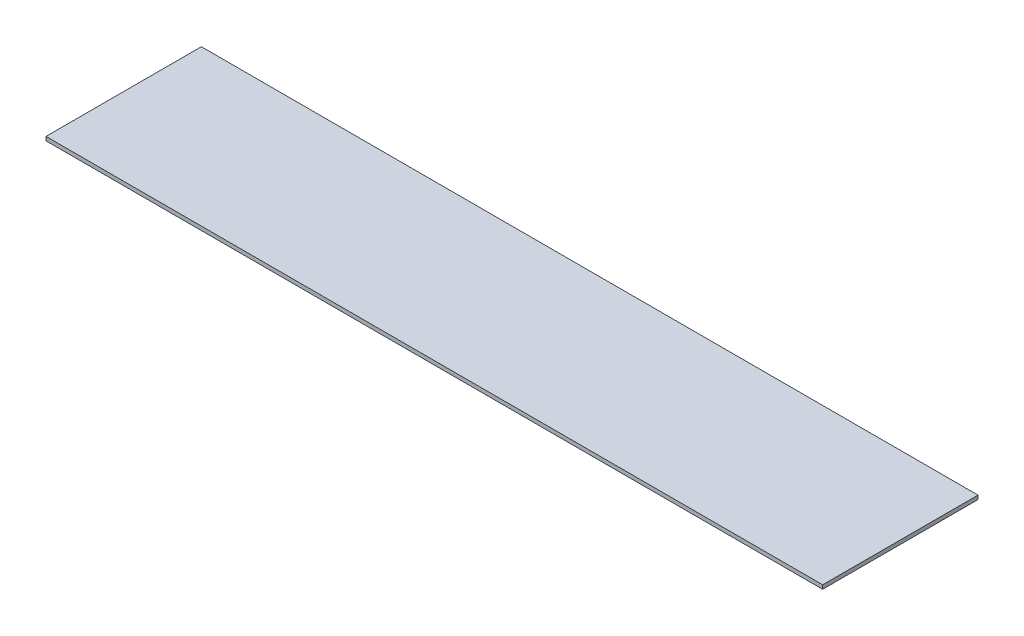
from build123d import *

# Parameters (mm, degrees)
ESQUISSE1_W        = 2000
ESQUISSE1_H        = 10
BOSS_EXTRU_1_DEPTH = 200


with BuildPart() as part:
    # Esquisse1 → Boss.-Extru.1 (new, symmetric)
    with BuildSketch(Plane.XY):
        with Locations((1000, -5)):
            Rectangle(ESQUISSE1_W, ESQUISSE1_H)
    extrude(amount=BOSS_EXTRU_1_DEPTH, both=True)


solid = part.part
